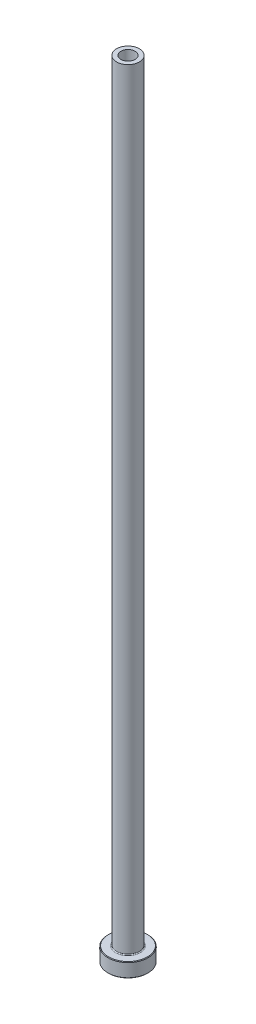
ISO-10303-21;
HEADER;
FILE_DESCRIPTION(('STEP AP214'),'2;1');
FILE_NAME('part.step','',(''),(''),'','','');
FILE_SCHEMA(('AUTOMOTIVE_DESIGN { 1 0 10303 214 1 1 1 1 }'));
ENDSEC;
DATA;
#1=APPLICATION_CONTEXT('core data for automotive mechanical design processes');
#2=APPLICATION_PROTOCOL_DEFINITION('international standard','automotive_design',2000,#1);
#3=PRODUCT_CONTEXT('',#1,'mechanical');
#4=PRODUCT('Part','Part','',(#3));
#5=PRODUCT_RELATED_PRODUCT_CATEGORY('part','',(#4));
#6=PRODUCT_DEFINITION_FORMATION('','',#4);
#7=PRODUCT_DEFINITION_CONTEXT('part definition',#1,'design');
#8=PRODUCT_DEFINITION('design','',#6,#7);
#9=PRODUCT_DEFINITION_SHAPE('','',#8);
#10=(LENGTH_UNIT() NAMED_UNIT(*) SI_UNIT(.MILLI.,.METRE.));
#11=(NAMED_UNIT(*) PLANE_ANGLE_UNIT() SI_UNIT($,.RADIAN.));
#12=(NAMED_UNIT(*) SI_UNIT($,.STERADIAN.) SOLID_ANGLE_UNIT());
#13=UNCERTAINTY_MEASURE_WITH_UNIT(LENGTH_MEASURE(1.E-05),#10,'distance_accuracy_value','');
#14=(GEOMETRIC_REPRESENTATION_CONTEXT(3) GLOBAL_UNCERTAINTY_ASSIGNED_CONTEXT((#13)) GLOBAL_UNIT_ASSIGNED_CONTEXT((#10,
#11,#12)) REPRESENTATION_CONTEXT('',''));
#15=CARTESIAN_POINT('',(0.,0.,0.));
#16=DIRECTION('',(0.,0.,1.));
#17=DIRECTION('',(1.,0.,0.));
#18=AXIS2_PLACEMENT_3D('',#15,#16,#17);
#19=CARTESIAN_POINT('',(0.,92.1876809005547,0.));
#20=DIRECTION('',(0.,1.,0.));
#21=DIRECTION('',(0.,0.,1.));
#22=AXIS2_PLACEMENT_3D('',#19,#20,#21);
#23=CYLINDRICAL_SURFACE('',#22,2.50000000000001);
#24=CARTESIAN_POINT('',(0.,275.,0.));
#25=DIRECTION('',(0.,1.,0.));
#26=DIRECTION('',(0.,0.,1.));
#27=AXIS2_PLACEMENT_3D('',#24,#25,#26);
#28=CIRCLE('',#27,2.50000000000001);
#29=CARTESIAN_POINT('',(0.,275.,2.50000000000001));
#30=VERTEX_POINT('',#29);
#31=EDGE_CURVE('E62',#30,#30,#28,.T.);
#32=ORIENTED_EDGE('',*,*,#31,.T.);
#33=EDGE_LOOP('',(#32));
#34=FACE_BOUND('',#33,.T.);
#35=CARTESIAN_POINT('',(0.,230.,0.));
#36=DIRECTION('',(0.,1.,0.));
#37=DIRECTION('',(0.,0.,1.));
#38=AXIS2_PLACEMENT_3D('',#35,#36,#37);
#39=CIRCLE('',#38,2.50000000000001);
#40=CARTESIAN_POINT('',(0.,230.,2.50000000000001));
#41=VERTEX_POINT('',#40);
#42=EDGE_CURVE('E71',#41,#41,#39,.T.);
#43=ORIENTED_EDGE('',*,*,#42,.F.);
#44=EDGE_LOOP('',(#43));
#45=FACE_BOUND('',#44,.T.);
#46=ADVANCED_FACE('F30',(#34,#45),#23,.F.);
#47=CARTESIAN_POINT('',(-2.50000000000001,275.,0.));
#48=DIRECTION('',(0.,1.,0.));
#49=DIRECTION('',(0.,0.,1.));
#50=AXIS2_PLACEMENT_3D('',#47,#48,#49);
#51=PLANE('',#50);
#52=CARTESIAN_POINT('',(0.,275.,0.));
#53=DIRECTION('',(0.,1.,0.));
#54=DIRECTION('',(0.,0.,1.));
#55=AXIS2_PLACEMENT_3D('',#52,#53,#54);
#56=CIRCLE('',#55,4.00000000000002);
#57=CARTESIAN_POINT('',(0.,275.,4.00000000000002));
#58=VERTEX_POINT('',#57);
#59=EDGE_CURVE('E65',#58,#58,#56,.T.);
#60=ORIENTED_EDGE('',*,*,#59,.T.);
#61=EDGE_LOOP('',(#60));
#62=FACE_BOUND('',#61,.T.);
#63=ORIENTED_EDGE('',*,*,#31,.F.);
#64=EDGE_LOOP('',(#63));
#65=FACE_BOUND('',#64,.T.);
#66=ADVANCED_FACE('F79',(#62,#65),#51,.T.);
#67=CARTESIAN_POINT('',(0.,92.1876809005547,0.));
#68=DIRECTION('',(0.,1.,0.));
#69=DIRECTION('',(0.,0.,1.));
#70=AXIS2_PLACEMENT_3D('',#67,#68,#69);
#71=CYLINDRICAL_SURFACE('',#70,4.00000000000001);
#72=CARTESIAN_POINT('',(0.,5.3,0.));
#73=DIRECTION('',(0.,1.,0.));
#74=DIRECTION('',(0.,0.,1.));
#75=AXIS2_PLACEMENT_3D('',#72,#73,#74);
#76=CIRCLE('',#75,4.00000000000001);
#77=CARTESIAN_POINT('',(0.,5.3,4.00000000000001));
#78=VERTEX_POINT('',#77);
#79=EDGE_CURVE('E59',#78,#78,#76,.T.);
#80=ORIENTED_EDGE('',*,*,#79,.T.);
#81=EDGE_LOOP('',(#80));
#82=FACE_BOUND('',#81,.T.);
#83=ORIENTED_EDGE('',*,*,#59,.F.);
#84=EDGE_LOOP('',(#83));
#85=FACE_BOUND('',#84,.T.);
#86=ADVANCED_FACE('F85',(#82,#85),#71,.T.);
#87=CARTESIAN_POINT('',(-3.99999999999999,5.,0.));
#88=DIRECTION('',(0.,1.,0.));
#89=DIRECTION('',(0.,0.,1.));
#90=AXIS2_PLACEMENT_3D('',#87,#88,#89);
#91=PLANE('',#90);
#92=CARTESIAN_POINT('',(0.,5.,0.));
#93=DIRECTION('',(0.,1.,0.));
#94=DIRECTION('',(0.,0.,1.));
#95=AXIS2_PLACEMENT_3D('',#92,#93,#94);
#96=CIRCLE('',#95,6.79999999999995);
#97=CARTESIAN_POINT('',(0.,5.,6.79999999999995));
#98=VERTEX_POINT('',#97);
#99=EDGE_CURVE('E53',#98,#98,#96,.T.);
#100=ORIENTED_EDGE('',*,*,#99,.T.);
#101=EDGE_LOOP('',(#100));
#102=FACE_BOUND('',#101,.T.);
#103=CARTESIAN_POINT('',(0.,5.,0.));
#104=DIRECTION('',(0.,1.,0.));
#105=DIRECTION('',(0.,0.,1.));
#106=AXIS2_PLACEMENT_3D('',#103,#104,#105);
#107=CIRCLE('',#106,4.30000000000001);
#108=CARTESIAN_POINT('',(0.,5.,4.30000000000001));
#109=VERTEX_POINT('',#108);
#110=EDGE_CURVE('E56',#109,#109,#107,.F.);
#111=ORIENTED_EDGE('',*,*,#110,.T.);
#112=EDGE_LOOP('',(#111));
#113=FACE_BOUND('',#112,.T.);
#114=ADVANCED_FACE('F111',(#102,#113),#91,.T.);
#115=CARTESIAN_POINT('',(0.,92.1876809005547,0.));
#116=DIRECTION('',(0.,1.,0.));
#117=DIRECTION('',(0.,0.,1.));
#118=AXIS2_PLACEMENT_3D('',#115,#116,#117);
#119=CYLINDRICAL_SURFACE('',#118,6.99999999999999);
#120=CARTESIAN_POINT('',(0.,4.79999999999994,0.));
#121=DIRECTION('',(0.,1.,0.));
#122=DIRECTION('',(0.,0.,1.));
#123=AXIS2_PLACEMENT_3D('',#120,#121,#122);
#124=CIRCLE('',#123,6.99999999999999);
#125=CARTESIAN_POINT('',(0.,4.79999999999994,6.99999999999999));
#126=VERTEX_POINT('',#125);
#127=EDGE_CURVE('E45',#126,#126,#124,.F.);
#128=ORIENTED_EDGE('',*,*,#127,.T.);
#129=EDGE_LOOP('',(#128));
#130=FACE_BOUND('',#129,.T.);
#131=CARTESIAN_POINT('',(0.,0.20000000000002,0.));
#132=DIRECTION('',(0.,-1.,0.));
#133=DIRECTION('',(0.,0.,-1.));
#134=AXIS2_PLACEMENT_3D('',#131,#132,#133);
#135=CIRCLE('',#134,6.99999999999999);
#136=CARTESIAN_POINT('',(0.,0.20000000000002,-6.99999999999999));
#137=VERTEX_POINT('',#136);
#138=EDGE_CURVE('E50',#137,#137,#135,.F.);
#139=ORIENTED_EDGE('',*,*,#138,.T.);
#140=EDGE_LOOP('',(#139));
#141=FACE_BOUND('',#140,.T.);
#142=ADVANCED_FACE('F108',(#130,#141),#119,.T.);
#143=CARTESIAN_POINT('',(-6.99999999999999,0.,0.));
#144=DIRECTION('',(0.,-1.,0.));
#145=DIRECTION('',(0.,0.,-1.));
#146=AXIS2_PLACEMENT_3D('',#143,#144,#145);
#147=PLANE('',#146);
#148=CARTESIAN_POINT('',(0.,0.,0.));
#149=DIRECTION('',(0.,-1.,0.));
#150=DIRECTION('',(0.,0.,-1.));
#151=AXIS2_PLACEMENT_3D('',#148,#149,#150);
#152=CIRCLE('',#151,3.25000000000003);
#153=CARTESIAN_POINT('',(0.,0.,-3.25000000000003));
#154=VERTEX_POINT('',#153);
#155=EDGE_CURVE('E37',#154,#154,#152,.F.);
#156=ORIENTED_EDGE('',*,*,#155,.T.);
#157=EDGE_LOOP('',(#156));
#158=FACE_BOUND('',#157,.T.);
#159=CARTESIAN_POINT('',(0.,0.,0.));
#160=DIRECTION('',(0.,-1.,0.));
#161=DIRECTION('',(0.,0.,-1.));
#162=AXIS2_PLACEMENT_3D('',#159,#160,#161);
#163=CIRCLE('',#162,6.79999999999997);
#164=CARTESIAN_POINT('',(0.,0.,-6.79999999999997));
#165=VERTEX_POINT('',#164);
#166=EDGE_CURVE('E41',#165,#165,#163,.T.);
#167=ORIENTED_EDGE('',*,*,#166,.T.);
#168=EDGE_LOOP('',(#167));
#169=FACE_BOUND('',#168,.T.);
#170=ADVANCED_FACE('F110',(#158,#169),#147,.T.);
#171=CARTESIAN_POINT('',(0.,92.1876809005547,0.));
#172=DIRECTION('',(0.,1.,0.));
#173=DIRECTION('',(0.,0.,1.));
#174=AXIS2_PLACEMENT_3D('',#171,#172,#173);
#175=CYLINDRICAL_SURFACE('',#174,2.75);
#176=CARTESIAN_POINT('',(0.,0.500000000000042,0.));
#177=DIRECTION('',(0.,-1.,0.));
#178=DIRECTION('',(0.,0.,-1.));
#179=AXIS2_PLACEMENT_3D('',#176,#177,#178);
#180=CIRCLE('',#179,2.75);
#181=CARTESIAN_POINT('',(0.,0.500000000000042,-2.75));
#182=VERTEX_POINT('',#181);
#183=EDGE_CURVE('E10',#182,#182,#180,.T.);
#184=ORIENTED_EDGE('',*,*,#183,.T.);
#185=EDGE_LOOP('',(#184));
#186=FACE_BOUND('',#185,.T.);
#187=CARTESIAN_POINT('',(0.,218.,0.));
#188=DIRECTION('',(0.,1.,0.));
#189=DIRECTION('',(0.,0.,1.));
#190=AXIS2_PLACEMENT_3D('',#187,#188,#189);
#191=CIRCLE('',#190,2.75000000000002);
#192=CARTESIAN_POINT('',(0.,218.,2.75000000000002));
#193=VERTEX_POINT('',#192);
#194=EDGE_CURVE('E68',#193,#193,#191,.T.);
#195=ORIENTED_EDGE('',*,*,#194,.T.);
#196=EDGE_LOOP('',(#195));
#197=FACE_BOUND('',#196,.T.);
#198=ADVANCED_FACE('F118',(#186,#197),#175,.F.);
#199=CARTESIAN_POINT('',(0.,218.,0.));
#200=DIRECTION('',(0.,-1.,0.));
#201=DIRECTION('',(0.,0.,-1.));
#202=AXIS2_PLACEMENT_3D('',#199,#200,#201);
#203=CONICAL_SURFACE('',#202,2.75000000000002,0.0208303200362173);
#204=ORIENTED_EDGE('',*,*,#42,.T.);
#205=EDGE_LOOP('',(#204));
#206=FACE_BOUND('',#205,.T.);
#207=ORIENTED_EDGE('',*,*,#194,.F.);
#208=EDGE_LOOP('',(#207));
#209=FACE_BOUND('',#208,.T.);
#210=ADVANCED_FACE('F75',(#206,#209),#203,.F.);
#211=CARTESIAN_POINT('',(0.,5.3,0.));
#212=DIRECTION('',(0.,1.,0.));
#213=DIRECTION('',(0.,0.,1.));
#214=AXIS2_PLACEMENT_3D('',#211,#212,#213);
#215=TOROIDAL_SURFACE('',#214,4.30000000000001,0.3);
#216=ORIENTED_EDGE('',*,*,#110,.F.);
#217=EDGE_LOOP('',(#216));
#218=FACE_BOUND('',#217,.T.);
#219=ORIENTED_EDGE('',*,*,#79,.F.);
#220=EDGE_LOOP('',(#219));
#221=FACE_BOUND('',#220,.T.);
#222=ADVANCED_FACE('F90',(#218,#221),#215,.F.);
#223=CARTESIAN_POINT('',(0.,5.,0.));
#224=DIRECTION('',(0.,-1.,0.));
#225=DIRECTION('',(0.,0.,-1.));
#226=AXIS2_PLACEMENT_3D('',#223,#224,#225);
#227=CONICAL_SURFACE('',#226,6.79999999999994,0.785398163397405);
#228=ORIENTED_EDGE('',*,*,#127,.F.);
#229=EDGE_LOOP('',(#228));
#230=FACE_BOUND('',#229,.T.);
#231=ORIENTED_EDGE('',*,*,#99,.F.);
#232=EDGE_LOOP('',(#231));
#233=FACE_BOUND('',#232,.T.);
#234=ADVANCED_FACE('F93',(#230,#233),#227,.T.);
#235=CARTESIAN_POINT('',(0.,0.20000000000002,0.));
#236=DIRECTION('',(0.,1.,0.));
#237=DIRECTION('',(0.,0.,1.));
#238=AXIS2_PLACEMENT_3D('',#235,#236,#237);
#239=CONICAL_SURFACE('',#238,6.99999999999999,0.78539816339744);
#240=ORIENTED_EDGE('',*,*,#166,.F.);
#241=EDGE_LOOP('',(#240));
#242=FACE_BOUND('',#241,.T.);
#243=ORIENTED_EDGE('',*,*,#138,.F.);
#244=EDGE_LOOP('',(#243));
#245=FACE_BOUND('',#244,.T.);
#246=ADVANCED_FACE('F96',(#242,#245),#239,.T.);
#247=CARTESIAN_POINT('',(0.,0.,0.));
#248=DIRECTION('',(0.,-1.,0.));
#249=DIRECTION('',(0.,0.,-1.));
#250=AXIS2_PLACEMENT_3D('',#247,#248,#249);
#251=CONICAL_SURFACE('',#250,3.25000000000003,0.785398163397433);
#252=ORIENTED_EDGE('',*,*,#183,.F.);
#253=EDGE_LOOP('',(#252));
#254=FACE_BOUND('',#253,.T.);
#255=ORIENTED_EDGE('',*,*,#155,.F.);
#256=EDGE_LOOP('',(#255));
#257=FACE_BOUND('',#256,.T.);
#258=ADVANCED_FACE('F32',(#254,#257),#251,.F.);
#259=CLOSED_SHELL('',(#46,#66,#86,#114,#142,#170,#198,#210,#222,#234,#246,#258));
#260=MANIFOLD_SOLID_BREP('B2',#259);
#261=ADVANCED_BREP_SHAPE_REPRESENTATION('',(#18,#260),#14);
#262=SHAPE_DEFINITION_REPRESENTATION(#9,#261);
ENDSEC;
END-ISO-10303-21;
